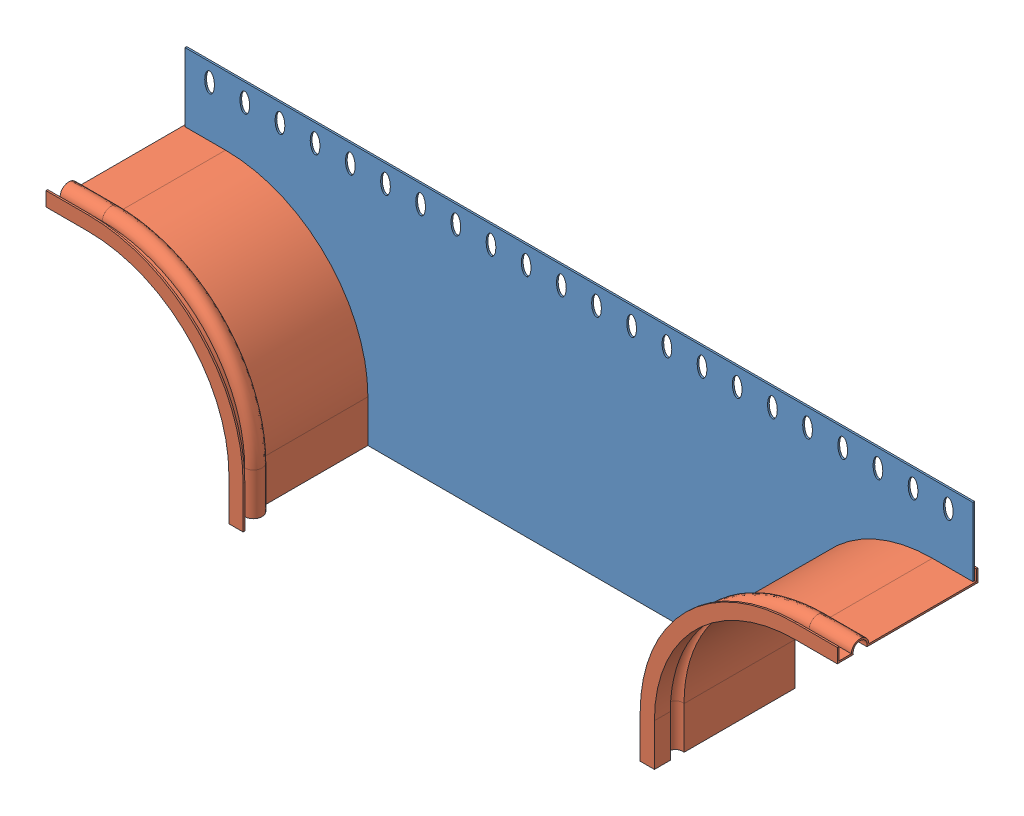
SolidWorks assembly FTB.SLDASM, configuration 100 300 (file format 4100). Lengths in mm.
Overall size (562.43 180 100).
3 component instances, 2 part files, 6 mates.
Components (placement in the parent):
- FTB base-1: FTB base.SLDPRT [50 300] at (-345.6729 78.2858 129.2207) size (560 180 1.21)
- ftt curve-1: ftt curve.SLDPRT [100] at (-476.8869 207.0718 129.2207) x (0 -1 0) z (-1 0 0) size (140.1 100 140.1)
- ftt curve-2: ftt curve.SLDPRT [100] at (-43.2449 78.2858 129.2207) x (1 0 0) z (0 -1 0) size (140.1 100 140.1)
Mates (geometry in assembly coordinates):
- Coincident1: coincident aligned: plane of ftt curve-1 through (-446.8869 209.4998 129.2207) normal (0 0 1); plane of ftt curve-2 through (-45.6729 108.2858 129.2207) normal (0 0 1)
- Coincident2: coincident anti-aligned: plane of FTB base-1 through (54.3271 108.2858 129.2207) normal (0 0 -1); plane of ftt curve-1 through (-446.8869 209.4998 129.2207) normal (0 0 1)
- Coincident3: coincident aligned: plane of FTB base-1 through (-345.6729 78.2858 130.4348) normal (0 -1 0); plane of ftt curve-1 through (-345.6729 78.2858 211.7927) normal (0 -1 0)
- Coincident4: coincident anti-aligned: plane of FTB base-1 through (-345.6729 108.2858 130.4348) normal (-1 0 0); plane of ftt curve-1 through (-345.6729 108.2858 205.5787) normal (1 0 0)
- Coincident5: coincident anti-aligned: plane of FTB base-1 through (-45.6729 78.2858 130.4348) normal (1 0 0); plane of ftt curve-2 through (-45.6729 108.2858 205.5787) normal (-1 0 0)
- Coincident6: coincident aligned: plane of FTB base-1 through (-345.6729 78.2858 130.4348) normal (0 -1 0); plane of ftt curve-2 through (-45.6729 78.2858 211.7927) normal (0 -1 0)
